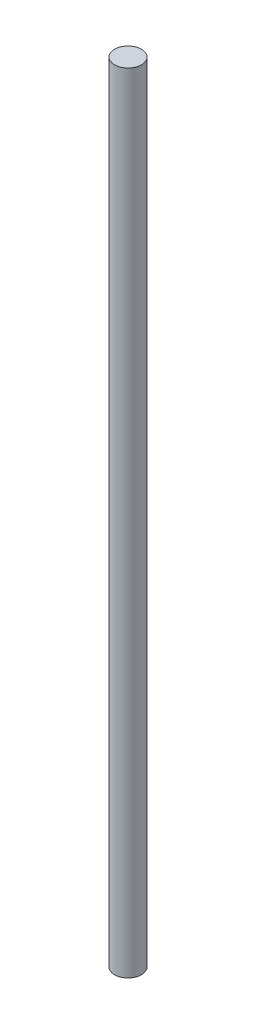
ISO-10303-21;
HEADER;
FILE_DESCRIPTION(('STEP AP214'),'2;1');
FILE_NAME('part.step','',(''),(''),'','','');
FILE_SCHEMA(('AUTOMOTIVE_DESIGN { 1 0 10303 214 1 1 1 1 }'));
ENDSEC;
DATA;
#1=APPLICATION_CONTEXT('core data for automotive mechanical design processes');
#2=APPLICATION_PROTOCOL_DEFINITION('international standard','automotive_design',2000,#1);
#3=PRODUCT_CONTEXT('',#1,'mechanical');
#4=PRODUCT('Part','Part','',(#3));
#5=PRODUCT_RELATED_PRODUCT_CATEGORY('part','',(#4));
#6=PRODUCT_DEFINITION_FORMATION('','',#4);
#7=PRODUCT_DEFINITION_CONTEXT('part definition',#1,'design');
#8=PRODUCT_DEFINITION('design','',#6,#7);
#9=PRODUCT_DEFINITION_SHAPE('','',#8);
#10=(LENGTH_UNIT() NAMED_UNIT(*) SI_UNIT(.MILLI.,.METRE.));
#11=(NAMED_UNIT(*) PLANE_ANGLE_UNIT() SI_UNIT($,.RADIAN.));
#12=(NAMED_UNIT(*) SI_UNIT($,.STERADIAN.) SOLID_ANGLE_UNIT());
#13=UNCERTAINTY_MEASURE_WITH_UNIT(LENGTH_MEASURE(1.E-05),#10,'distance_accuracy_value','');
#14=(GEOMETRIC_REPRESENTATION_CONTEXT(3) GLOBAL_UNCERTAINTY_ASSIGNED_CONTEXT((#13)) GLOBAL_UNIT_ASSIGNED_CONTEXT((#10,
#11,#12)) REPRESENTATION_CONTEXT('',''));
#15=CARTESIAN_POINT('',(0.,0.,0.));
#16=DIRECTION('',(0.,0.,1.));
#17=DIRECTION('',(1.,0.,0.));
#18=AXIS2_PLACEMENT_3D('',#15,#16,#17);
#19=CARTESIAN_POINT('',(0.,190.,0.));
#20=DIRECTION('',(0.,-1.,0.));
#21=DIRECTION('',(0.,0.,-1.));
#22=AXIS2_PLACEMENT_3D('',#19,#20,#21);
#23=CYLINDRICAL_SURFACE('',#22,3.25);
#24=CARTESIAN_POINT('',(0.,190.,0.));
#25=DIRECTION('',(0.,1.,0.));
#26=DIRECTION('',(0.,0.,1.));
#27=AXIS2_PLACEMENT_3D('',#24,#25,#26);
#28=CIRCLE('',#27,3.25);
#29=CARTESIAN_POINT('',(0.,190.,3.25));
#30=VERTEX_POINT('',#29);
#31=EDGE_CURVE('E10',#30,#30,#28,.T.);
#32=ORIENTED_EDGE('',*,*,#31,.F.);
#33=EDGE_LOOP('',(#32));
#34=FACE_BOUND('',#33,.T.);
#35=CARTESIAN_POINT('',(0.,0.,0.));
#36=DIRECTION('',(0.,1.,0.));
#37=DIRECTION('',(0.,0.,1.));
#38=AXIS2_PLACEMENT_3D('',#35,#36,#37);
#39=CIRCLE('',#38,3.25);
#40=CARTESIAN_POINT('',(0.,0.,3.25));
#41=VERTEX_POINT('',#40);
#42=EDGE_CURVE('E30',#41,#41,#39,.T.);
#43=ORIENTED_EDGE('',*,*,#42,.T.);
#44=EDGE_LOOP('',(#43));
#45=FACE_BOUND('',#44,.T.);
#46=ADVANCED_FACE('F24',(#34,#45),#23,.T.);
#47=CARTESIAN_POINT('',(0.,190.,0.));
#48=DIRECTION('',(0.,1.,0.));
#49=DIRECTION('',(0.,0.,1.));
#50=AXIS2_PLACEMENT_3D('',#47,#48,#49);
#51=PLANE('',#50);
#52=ORIENTED_EDGE('',*,*,#31,.T.);
#53=EDGE_LOOP('',(#52));
#54=FACE_BOUND('',#53,.T.);
#55=ADVANCED_FACE('F39',(#54),#51,.T.);
#56=CARTESIAN_POINT('',(0.,0.,0.));
#57=DIRECTION('',(0.,1.,0.));
#58=DIRECTION('',(0.,0.,1.));
#59=AXIS2_PLACEMENT_3D('',#56,#57,#58);
#60=PLANE('',#59);
#61=ORIENTED_EDGE('',*,*,#42,.F.);
#62=EDGE_LOOP('',(#61));
#63=FACE_BOUND('',#62,.T.);
#64=ADVANCED_FACE('F37',(#63),#60,.F.);
#65=CLOSED_SHELL('',(#46,#55,#64));
#66=MANIFOLD_SOLID_BREP('B2',#65);
#67=ADVANCED_BREP_SHAPE_REPRESENTATION('',(#18,#66),#14);
#68=SHAPE_DEFINITION_REPRESENTATION(#9,#67);
ENDSEC;
END-ISO-10303-21;
